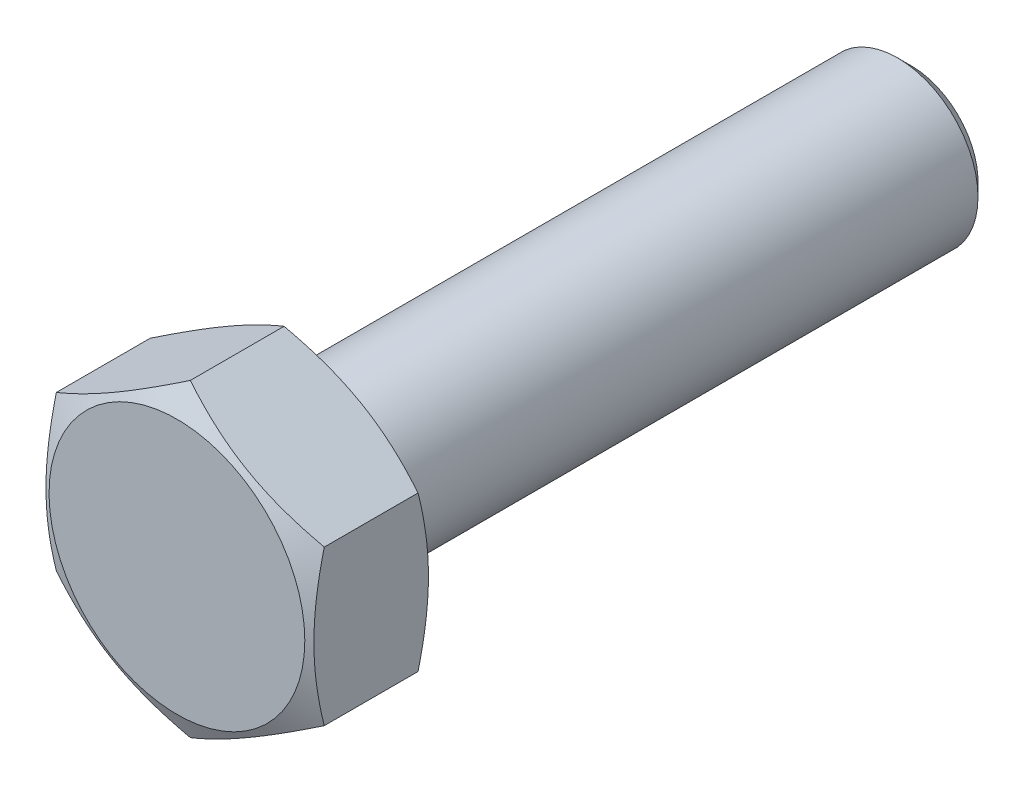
ISO-10303-21;
HEADER;
FILE_DESCRIPTION(('STEP AP214'),'2;1');
FILE_NAME('part.step','',(''),(''),'','','');
FILE_SCHEMA(('AUTOMOTIVE_DESIGN { 1 0 10303 214 1 1 1 1 }'));
ENDSEC;
DATA;
#1=APPLICATION_CONTEXT('core data for automotive mechanical design processes');
#2=APPLICATION_PROTOCOL_DEFINITION('international standard','automotive_design',2000,#1);
#3=PRODUCT_CONTEXT('',#1,'mechanical');
#4=PRODUCT('Part','Part','',(#3));
#5=PRODUCT_RELATED_PRODUCT_CATEGORY('part','',(#4));
#6=PRODUCT_DEFINITION_FORMATION('','',#4);
#7=PRODUCT_DEFINITION_CONTEXT('part definition',#1,'design');
#8=PRODUCT_DEFINITION('design','',#6,#7);
#9=PRODUCT_DEFINITION_SHAPE('','',#8);
#10=(LENGTH_UNIT() NAMED_UNIT(*) SI_UNIT(.MILLI.,.METRE.));
#11=(NAMED_UNIT(*) PLANE_ANGLE_UNIT() SI_UNIT($,.RADIAN.));
#12=(NAMED_UNIT(*) SI_UNIT($,.STERADIAN.) SOLID_ANGLE_UNIT());
#13=UNCERTAINTY_MEASURE_WITH_UNIT(LENGTH_MEASURE(1.E-05),#10,'distance_accuracy_value','');
#14=(GEOMETRIC_REPRESENTATION_CONTEXT(3) GLOBAL_UNCERTAINTY_ASSIGNED_CONTEXT((#13)) GLOBAL_UNIT_ASSIGNED_CONTEXT((#10,
#11,#12)) REPRESENTATION_CONTEXT('',''));
#15=CARTESIAN_POINT('',(0.,0.,0.));
#16=DIRECTION('',(0.,0.,1.));
#17=DIRECTION('',(1.,0.,0.));
#18=AXIS2_PLACEMENT_3D('',#15,#16,#17);
#19=CARTESIAN_POINT('',(5.,2.88675134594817,-4.5));
#20=DIRECTION('',(0.,0.,-1.));
#21=DIRECTION('',(-1.,0.,0.));
#22=AXIS2_PLACEMENT_3D('',#19,#20,#21);
#23=PLANE('',#22);
#24=CARTESIAN_POINT('',(0.,0.,-4.5));
#25=DIRECTION('',(0.,0.,1.));
#26=DIRECTION('',(1.,0.,0.));
#27=AXIS2_PLACEMENT_3D('',#24,#25,#26);
#28=CIRCLE('',#27,4.77350269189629);
#29=CARTESIAN_POINT('',(4.77350269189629,0.,-4.5));
#30=VERTEX_POINT('',#29);
#31=EDGE_CURVE('E546',#30,#30,#28,.T.);
#32=ORIENTED_EDGE('',*,*,#31,.F.);
#33=EDGE_LOOP('',(#32));
#34=FACE_BOUND('',#33,.T.);
#35=CARTESIAN_POINT('',(0.,0.,-4.5));
#36=DIRECTION('',(0.,0.,1.));
#37=DIRECTION('',(1.,0.,0.));
#38=AXIS2_PLACEMENT_3D('',#35,#36,#37);
#39=CIRCLE('',#38,2.85);
#40=CARTESIAN_POINT('',(2.85,0.,-4.5));
#41=VERTEX_POINT('',#40);
#42=EDGE_CURVE('E549',#41,#41,#39,.T.);
#43=ORIENTED_EDGE('',*,*,#42,.T.);
#44=EDGE_LOOP('',(#43));
#45=FACE_BOUND('',#44,.T.);
#46=ADVANCED_FACE('F352',(#34,#45),#23,.T.);
#47=CARTESIAN_POINT('',(0.,0.,-4.));
#48=DIRECTION('',(0.,0.,1.));
#49=DIRECTION('',(1.,0.,0.));
#50=AXIS2_PLACEMENT_3D('',#47,#48,#49);
#51=CONICAL_SURFACE('',#50,5.77350269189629,1.10714871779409);
#52=ORIENTED_EDGE('',*,*,#31,.T.);
#53=EDGE_LOOP('',(#52));
#54=FACE_BOUND('',#53,.T.);
#55=CARTESIAN_POINT('',(5.,-7.64036599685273,-2.32125048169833));
#56=CARTESIAN_POINT('',(5.,-7.41641352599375,-2.41491890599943));
#57=CARTESIAN_POINT('',(5.,-7.1920335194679,-2.50758419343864));
#58=CARTESIAN_POINT('',(5.,-6.74218875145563,-2.69033469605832));
#59=CARTESIAN_POINT('',(5.,-6.51672383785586,-2.78041953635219));
#60=CARTESIAN_POINT('',(5.,-6.06363519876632,-2.957763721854));
#61=CARTESIAN_POINT('',(5.,-5.83600643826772,-3.04501025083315));
#62=CARTESIAN_POINT('',(5.,-5.37924898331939,-3.2154711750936));
#63=CARTESIAN_POINT('',(5.,-5.15012035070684,-3.29868573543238));
#64=CARTESIAN_POINT('',(5.,-4.69320015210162,-3.45892511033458));
#65=CARTESIAN_POINT('',(5.,-4.46543286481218,-3.53601878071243));
#66=CARTESIAN_POINT('',(5.,-4.00783934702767,-3.68392873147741));
#67=CARTESIAN_POINT('',(5.,-3.77801298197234,-3.75474459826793));
#68=CARTESIAN_POINT('',(5.,-3.31631663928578,-3.88831127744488));
#69=CARTESIAN_POINT('',(5.,-3.08444962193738,-3.95107220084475));
#70=CARTESIAN_POINT('',(5.,-2.61825844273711,-4.06654482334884));
#71=CARTESIAN_POINT('',(5.,-2.3839347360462,-4.11925835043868));
#72=CARTESIAN_POINT('',(5.,-1.84988522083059,-4.22464925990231));
#73=CARTESIAN_POINT('',(5.,-1.54938237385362,-4.27356824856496));
#74=CARTESIAN_POINT('',(5.,-1.09646445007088,-4.3283971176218));
#75=CARTESIAN_POINT('',(5.,-0.94514546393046,-4.34358125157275));
#76=CARTESIAN_POINT('',(5.,-0.641979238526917,-4.36733897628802));
#77=CARTESIAN_POINT('',(5.,-0.490132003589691,-4.37591262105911));
#78=CARTESIAN_POINT('',(5.,-0.185604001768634,-4.38618760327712));
#79=CARTESIAN_POINT('',(5.,-0.0329223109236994,-4.38786167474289));
#80=CARTESIAN_POINT('',(5.,0.272359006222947,-4.38420797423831));
#81=CARTESIAN_POINT('',(5.,0.424958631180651,-4.3788800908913));
#82=CARTESIAN_POINT('',(5.,0.729745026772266,-4.36139946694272));
#83=CARTESIAN_POINT('',(5.,0.881931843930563,-4.34924753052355));
#84=CARTESIAN_POINT('',(5.,1.18563651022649,-4.31850255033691));
#85=CARTESIAN_POINT('',(5.,1.33715439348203,-4.29990983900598));
#86=CARTESIAN_POINT('',(5.,1.70863721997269,-4.24691969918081));
#87=CARTESIAN_POINT('',(5.,1.92812791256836,-4.20918449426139));
#88=CARTESIAN_POINT('',(5.,2.3650239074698,-4.1230142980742));
#89=CARTESIAN_POINT('',(5.,2.58242857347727,-4.07457614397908));
#90=CARTESIAN_POINT('',(5.,3.0153417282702,-3.96885167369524));
#91=CARTESIAN_POINT('',(5.,3.23084750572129,-3.91155436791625));
#92=CARTESIAN_POINT('',(5.,3.65980768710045,-3.78985788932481));
#93=CARTESIAN_POINT('',(5.,3.8732622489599,-3.72545926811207));
#94=CARTESIAN_POINT('',(5.,4.2999453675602,-3.59046413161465));
#95=CARTESIAN_POINT('',(5.,4.51316032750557,-3.51982491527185));
#96=CARTESIAN_POINT('',(5.,4.93799569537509,-3.37391851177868));
#97=CARTESIAN_POINT('',(5.,5.14961608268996,-3.29865126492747));
#98=CARTESIAN_POINT('',(5.,5.57135611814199,-3.14444821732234));
#99=CARTESIAN_POINT('',(5.,5.78147664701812,-3.06551481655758));
#100=CARTESIAN_POINT('',(5.,6.2005631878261,-2.90463477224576));
#101=CARTESIAN_POINT('',(5.,6.40952917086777,-2.82268805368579));
#102=CARTESIAN_POINT('',(5.,7.0394166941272,-2.57141566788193));
#103=CARTESIAN_POINT('',(5.,7.45883645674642,-2.39832815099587));
#104=CARTESIAN_POINT('',(5.,8.29487839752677,-2.04538981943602));
#105=CARTESIAN_POINT('',(5.,8.71150009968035,-1.86553788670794));
#106=CARTESIAN_POINT('',(5.,9.5356228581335,-1.50414959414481));
#107=CARTESIAN_POINT('',(5.,9.94315902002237,-1.32269313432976));
#108=CARTESIAN_POINT('',(5.,10.553266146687,-1.04800855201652));
#109=CARTESIAN_POINT('',(5.,10.7564078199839,-0.956043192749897));
#110=CARTESIAN_POINT('',(5.,11.1623558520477,-0.771379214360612));
#111=CARTESIAN_POINT('',(5.,11.3651622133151,-0.678680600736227));
#112=CARTESIAN_POINT('',(5.,11.5678248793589,-0.585668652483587));
#113=B_SPLINE_CURVE_WITH_KNOTS('',3,(#55,#56,#57,#58,#59,#60,#61,#62,#63,#64,#65,#66,#67,#68,
#69,#70,#71,#72,#73,#74,#75,#76,#77,#78,#79,#80,#81,#82,#83,#84,#85,#86,#87,#88,#89,#90,#91,#92,
#93,#94,#95,#96,#97,#98,#99,#100,#101,#102,#103,#104,#105,#106,#107,#108,#109,#110,#111,#112),
.UNSPECIFIED.,.F.,.F.,(4,2,2,2,2,2,2,2,2,2,2,2,2,2,2,2,2,2,2,2,2,2,2,2,2,2,2,2,4),(0.,
0.728264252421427,1.45663377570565,2.18793174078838,2.91919974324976,3.64051008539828,
4.36186791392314,5.08231120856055,5.80262330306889,6.71502470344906,7.17114003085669,
7.62725163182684,8.08516399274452,8.54308363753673,9.00094932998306,9.4587913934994,
10.1265851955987,10.7945766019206,11.4634033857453,12.1321782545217,12.8059483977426,
13.4797272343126,14.153071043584,14.8264316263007,16.1875243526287,17.5488430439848,
18.8871439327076,19.5561104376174,20.2250719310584),.UNSPECIFIED.);
#114=CARTESIAN_POINT('',(5.0000000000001,-2.88675134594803,-4.));
#115=VERTEX_POINT('',#114);
#116=CARTESIAN_POINT('',(5.,2.8867513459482,-4.));
#117=VERTEX_POINT('',#116);
#118=EDGE_CURVE('E408',#115,#117,#113,.T.);
#119=ORIENTED_EDGE('',*,*,#118,.F.);
#120=CARTESIAN_POINT('',(-0.000199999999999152,-5.77361816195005,-3.9999422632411));
#121=CARTESIAN_POINT('',(0.140726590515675,-5.69225415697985,-4.04062369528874));
#122=CARTESIAN_POINT('',(0.282202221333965,-5.61057316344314,-4.07889097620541));
#123=CARTESIAN_POINT('',(0.566280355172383,-5.44656057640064,-4.14979140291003));
#124=CARTESIAN_POINT('',(0.70888339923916,-5.36422867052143,-4.18242164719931));
#125=CARTESIAN_POINT('',(0.995312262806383,-5.19885888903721,-4.24124222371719));
#126=CARTESIAN_POINT('',(1.13913957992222,-5.11582014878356,-4.26742295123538));
#127=CARTESIAN_POINT('',(1.42763357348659,-4.94925806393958,-4.31247492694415));
#128=CARTESIAN_POINT('',(1.57230010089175,-4.86573480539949,-4.33134743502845));
#129=CARTESIAN_POINT('',(1.85896625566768,-4.70022802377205,-4.36078685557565));
#130=CARTESIAN_POINT('',(2.00095198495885,-4.61825252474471,-4.37153237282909));
#131=CARTESIAN_POINT('',(2.28521904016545,-4.45413086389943,-4.38501401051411));
#132=CARTESIAN_POINT('',(2.42750038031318,-4.37198469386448,-4.38774973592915));
#133=CARTESIAN_POINT('',(2.71185220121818,-4.20781409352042,-4.38510569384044));
#134=CARTESIAN_POINT('',(2.85392274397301,-4.125789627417,-4.37973466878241));
#135=CARTESIAN_POINT('',(3.13765894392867,-3.96197445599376,-4.36110026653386));
#136=CARTESIAN_POINT('',(3.27932463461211,-3.88018373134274,-4.34783756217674));
#137=CARTESIAN_POINT('',(3.55309412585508,-3.7221228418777,-4.31496770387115));
#138=CARTESIAN_POINT('',(3.68523915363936,-3.64582887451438,-4.2958118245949));
#139=CARTESIAN_POINT('',(3.94878685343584,-3.49366953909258,-4.25153571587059));
#140=CARTESIAN_POINT('',(4.08018944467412,-3.41780421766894,-4.22641484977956));
#141=CARTESIAN_POINT('',(4.34359688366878,-3.26572586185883,-4.17052416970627));
#142=CARTESIAN_POINT('',(4.47559210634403,-3.18951838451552,-4.13969448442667));
#143=CARTESIAN_POINT('',(4.73861395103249,-3.03766265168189,-4.07324670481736));
#144=CARTESIAN_POINT('',(4.86964099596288,-2.96201415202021,-4.03763084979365));
#145=CARTESIAN_POINT('',(5.0002,-2.88663587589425,-3.99994226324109));
#146=B_SPLINE_CURVE_WITH_KNOTS('',3,(#120,#121,#122,#123,#124,#125,#126,#127,#128,#129,#130,
#131,#132,#133,#134,#135,#136,#137,#138,#139,#140,#141,#142,#143,#144,#145),.UNSPECIFIED.,.F.,
.F.,(4,2,2,2,2,2,2,2,2,2,2,2,4),(0.,0.503233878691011,1.00672601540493,1.51096348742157,
2.01511399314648,2.50783431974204,3.00057894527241,3.49279256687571,3.9849642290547,
4.44619450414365,4.90747402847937,5.37389760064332,5.84010370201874),.UNSPECIFIED.);
#147=CARTESIAN_POINT('',(1.37476835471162E-13,-5.77350269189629,-4.));
#148=VERTEX_POINT('',#147);
#149=EDGE_CURVE('E421',#148,#115,#146,.T.);
#150=ORIENTED_EDGE('',*,*,#149,.F.);
#151=CARTESIAN_POINT('',(-5.0002,-2.88663587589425,-3.9999422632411));
#152=CARTESIAN_POINT('',(-4.85927340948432,-2.96799988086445,-4.04062369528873));
#153=CARTESIAN_POINT('',(-4.71779777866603,-3.04968087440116,-4.0788909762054));
#154=CARTESIAN_POINT('',(-4.43371964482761,-3.21369346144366,-4.14979140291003));
#155=CARTESIAN_POINT('',(-4.29111660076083,-3.29602536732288,-4.1824216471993));
#156=CARTESIAN_POINT('',(-4.00468773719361,-3.46139514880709,-4.24124222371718));
#157=CARTESIAN_POINT('',(-3.86086042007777,-3.54443388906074,-4.26742295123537));
#158=CARTESIAN_POINT('',(-3.5723664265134,-3.71099597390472,-4.31247492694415));
#159=CARTESIAN_POINT('',(-3.42769989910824,-3.79451923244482,-4.33134743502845));
#160=CARTESIAN_POINT('',(-3.14103374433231,-3.96002601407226,-4.36078685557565));
#161=CARTESIAN_POINT('',(-2.99904801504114,-4.0420015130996,-4.37153237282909));
#162=CARTESIAN_POINT('',(-2.71478095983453,-4.20612317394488,-4.38501401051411));
#163=CARTESIAN_POINT('',(-2.57249961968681,-4.28826934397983,-4.38774973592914));
#164=CARTESIAN_POINT('',(-2.2881477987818,-4.45243994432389,-4.38510569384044));
#165=CARTESIAN_POINT('',(-2.14607725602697,-4.53446441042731,-4.37973466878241));
#166=CARTESIAN_POINT('',(-1.86234105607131,-4.69827958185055,-4.36110026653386));
#167=CARTESIAN_POINT('',(-1.72067536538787,-4.78007030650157,-4.34783756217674));
#168=CARTESIAN_POINT('',(-1.4469058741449,-4.93813119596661,-4.31496770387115));
#169=CARTESIAN_POINT('',(-1.31476084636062,-5.01442516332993,-4.2958118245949));
#170=CARTESIAN_POINT('',(-1.05121314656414,-5.16658449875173,-4.2515357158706));
#171=CARTESIAN_POINT('',(-0.919810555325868,-5.24244982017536,-4.22641484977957));
#172=CARTESIAN_POINT('',(-0.656403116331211,-5.39452817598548,-4.17052416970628));
#173=CARTESIAN_POINT('',(-0.524407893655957,-5.47073565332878,-4.13969448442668));
#174=CARTESIAN_POINT('',(-0.261386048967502,-5.62259138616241,-4.07324670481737));
#175=CARTESIAN_POINT('',(-0.130359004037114,-5.69823988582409,-4.03763084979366));
#176=CARTESIAN_POINT('',(0.000200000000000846,-5.77361816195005,-3.9999422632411));
#177=B_SPLINE_CURVE_WITH_KNOTS('',3,(#151,#152,#153,#154,#155,#156,#157,#158,#159,#160,#161,
#162,#163,#164,#165,#166,#167,#168,#169,#170,#171,#172,#173,#174,#175,#176),.UNSPECIFIED.,.F.,
.F.,(4,2,2,2,2,2,2,2,2,2,2,2,4),(0.,0.503233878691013,1.00672601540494,1.51096348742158,
2.01511399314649,2.50783431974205,3.00057894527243,3.49279256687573,3.98496422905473,
4.44619450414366,4.90747402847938,5.37389760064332,5.84010370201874),.UNSPECIFIED.);
#178=CARTESIAN_POINT('',(-5.,-2.88675134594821,-4.));
#179=VERTEX_POINT('',#178);
#180=EDGE_CURVE('E500',#179,#148,#177,.T.);
#181=ORIENTED_EDGE('',*,*,#180,.F.);
#182=CARTESIAN_POINT('',(-5.,-7.64036599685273,-2.32125048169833));
#183=CARTESIAN_POINT('',(-5.,-7.41641352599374,-2.41491890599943));
#184=CARTESIAN_POINT('',(-5.,-7.1920335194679,-2.50758419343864));
#185=CARTESIAN_POINT('',(-5.,-6.74218875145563,-2.69033469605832));
#186=CARTESIAN_POINT('',(-5.,-6.51672383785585,-2.78041953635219));
#187=CARTESIAN_POINT('',(-5.,-6.06363519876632,-2.95776372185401));
#188=CARTESIAN_POINT('',(-5.,-5.83600643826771,-3.04501025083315));
#189=CARTESIAN_POINT('',(-5.,-5.37924898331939,-3.2154711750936));
#190=CARTESIAN_POINT('',(-5.,-5.15012035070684,-3.29868573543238));
#191=CARTESIAN_POINT('',(-5.,-4.69320015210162,-3.45892511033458));
#192=CARTESIAN_POINT('',(-5.,-4.46543286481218,-3.53601878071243));
#193=CARTESIAN_POINT('',(-5.,-4.00783934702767,-3.68392873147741));
#194=CARTESIAN_POINT('',(-5.,-3.77801298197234,-3.75474459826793));
#195=CARTESIAN_POINT('',(-5.,-3.31631663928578,-3.88831127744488));
#196=CARTESIAN_POINT('',(-5.,-3.08444962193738,-3.95107220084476));
#197=CARTESIAN_POINT('',(-5.,-2.61825844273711,-4.06654482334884));
#198=CARTESIAN_POINT('',(-5.,-2.3839347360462,-4.11925835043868));
#199=CARTESIAN_POINT('',(-5.,-1.8498852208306,-4.22464925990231));
#200=CARTESIAN_POINT('',(-5.,-1.54938237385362,-4.27356824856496));
#201=CARTESIAN_POINT('',(-5.,-1.09646445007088,-4.3283971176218));
#202=CARTESIAN_POINT('',(-5.,-0.945145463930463,-4.34358125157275));
#203=CARTESIAN_POINT('',(-5.,-0.64197923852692,-4.36733897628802));
#204=CARTESIAN_POINT('',(-5.,-0.490132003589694,-4.37591262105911));
#205=CARTESIAN_POINT('',(-5.,-0.185604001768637,-4.38618760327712));
#206=CARTESIAN_POINT('',(-5.,-0.0329223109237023,-4.38786167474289));
#207=CARTESIAN_POINT('',(-5.,0.272359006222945,-4.38420797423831));
#208=CARTESIAN_POINT('',(-5.,0.424958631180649,-4.3788800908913));
#209=CARTESIAN_POINT('',(-5.,0.729745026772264,-4.36139946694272));
#210=CARTESIAN_POINT('',(-5.,0.88193184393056,-4.34924753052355));
#211=CARTESIAN_POINT('',(-5.,1.18563651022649,-4.31850255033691));
#212=CARTESIAN_POINT('',(-5.,1.33715439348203,-4.29990983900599));
#213=CARTESIAN_POINT('',(-5.,1.70863721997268,-4.24691969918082));
#214=CARTESIAN_POINT('',(-5.,1.92812791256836,-4.20918449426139));
#215=CARTESIAN_POINT('',(-5.,2.36502390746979,-4.1230142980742));
#216=CARTESIAN_POINT('',(-5.,2.58242857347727,-4.07457614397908));
#217=CARTESIAN_POINT('',(-5.,3.0153417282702,-3.96885167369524));
#218=CARTESIAN_POINT('',(-5.,3.23084750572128,-3.91155436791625));
#219=CARTESIAN_POINT('',(-5.,3.65980768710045,-3.78985788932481));
#220=CARTESIAN_POINT('',(-5.,3.8732622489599,-3.72545926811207));
#221=CARTESIAN_POINT('',(-5.,4.29994536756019,-3.59046413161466));
#222=CARTESIAN_POINT('',(-5.,4.51316032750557,-3.51982491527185));
#223=CARTESIAN_POINT('',(-5.,4.93799569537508,-3.37391851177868));
#224=CARTESIAN_POINT('',(-5.,5.14961608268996,-3.29865126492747));
#225=CARTESIAN_POINT('',(-5.,5.57135611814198,-3.14444821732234));
#226=CARTESIAN_POINT('',(-5.,5.78147664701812,-3.06551481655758));
#227=CARTESIAN_POINT('',(-5.,6.2005631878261,-2.90463477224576));
#228=CARTESIAN_POINT('',(-5.,6.40952917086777,-2.82268805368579));
#229=CARTESIAN_POINT('',(-5.,7.0394166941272,-2.57141566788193));
#230=CARTESIAN_POINT('',(-5.,7.45883645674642,-2.39832815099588));
#231=CARTESIAN_POINT('',(-5.,8.29487839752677,-2.04538981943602));
#232=CARTESIAN_POINT('',(-5.,8.71150009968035,-1.86553788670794));
#233=CARTESIAN_POINT('',(-5.,9.5356228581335,-1.50414959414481));
#234=CARTESIAN_POINT('',(-5.,9.94315902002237,-1.32269313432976));
#235=CARTESIAN_POINT('',(-5.,10.553266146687,-1.04800855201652));
#236=CARTESIAN_POINT('',(-5.,10.7564078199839,-0.956043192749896));
#237=CARTESIAN_POINT('',(-5.,11.1623558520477,-0.771379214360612));
#238=CARTESIAN_POINT('',(-5.,11.3651622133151,-0.678680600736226));
#239=CARTESIAN_POINT('',(-5.,11.5678248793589,-0.585668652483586));
#240=B_SPLINE_CURVE_WITH_KNOTS('',3,(#182,#183,#184,#185,#186,#187,#188,#189,#190,#191,#192,
#193,#194,#195,#196,#197,#198,#199,#200,#201,#202,#203,#204,#205,#206,#207,#208,#209,#210,#211,
#212,#213,#214,#215,#216,#217,#218,#219,#220,#221,#222,#223,#224,#225,#226,#227,#228,#229,#230,
#231,#232,#233,#234,#235,#236,#237,#238,#239),.UNSPECIFIED.,.F.,.F.,(4,2,2,2,2,2,2,2,2,2,2,2,2,
2,2,2,2,2,2,2,2,2,2,2,2,2,2,2,4),(0.,0.728264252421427,1.45663377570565,2.18793174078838,
2.91919974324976,3.64051008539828,4.36186791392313,5.08231120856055,5.80262330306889,
6.71502470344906,7.17114003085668,7.62725163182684,8.08516399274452,8.54308363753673,
9.00094932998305,9.45879139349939,10.1265851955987,10.7945766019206,11.4634033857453,
12.1321782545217,12.8059483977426,13.4797272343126,14.153071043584,14.8264316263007,
16.1875243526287,17.5488430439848,18.8871439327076,19.5561104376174,20.2250719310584),.UNSPECIFIED.);
#241=CARTESIAN_POINT('',(-5.,2.88675134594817,-4.));
#242=VERTEX_POINT('',#241);
#243=EDGE_CURVE('E368',#242,#179,#240,.F.);
#244=ORIENTED_EDGE('',*,*,#243,.F.);
#245=CARTESIAN_POINT('',(0.000199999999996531,5.77361816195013,-3.99994226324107));
#246=CARTESIAN_POINT('',(-0.140726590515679,5.69225415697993,-4.0406236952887));
#247=CARTESIAN_POINT('',(-0.282202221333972,5.61057316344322,-4.07889097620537));
#248=CARTESIAN_POINT('',(-0.566280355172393,5.44656057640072,-4.14979140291));
#249=CARTESIAN_POINT('',(-0.708883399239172,5.3642286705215,-4.18242164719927));
#250=CARTESIAN_POINT('',(-0.995312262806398,5.19885888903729,-4.24124222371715));
#251=CARTESIAN_POINT('',(-1.13913957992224,5.11582014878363,-4.26742295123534));
#252=CARTESIAN_POINT('',(-1.42763357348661,4.94925806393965,-4.31247492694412));
#253=CARTESIAN_POINT('',(-1.57230010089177,4.86573480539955,-4.33134743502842));
#254=CARTESIAN_POINT('',(-1.85896625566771,4.70022802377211,-4.36078685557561));
#255=CARTESIAN_POINT('',(-2.00095198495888,4.61825252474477,-4.37153237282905));
#256=CARTESIAN_POINT('',(-2.28521904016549,4.45413086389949,-4.38501401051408));
#257=CARTESIAN_POINT('',(-2.42750038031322,4.37198469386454,-4.38774973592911));
#258=CARTESIAN_POINT('',(-2.71185220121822,4.20781409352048,-4.3851056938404));
#259=CARTESIAN_POINT('',(-2.85392274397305,4.12578962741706,-4.37973466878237));
#260=CARTESIAN_POINT('',(-3.13765894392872,3.96197445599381,-4.36110026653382));
#261=CARTESIAN_POINT('',(-3.27932463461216,3.88018373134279,-4.3478375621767));
#262=CARTESIAN_POINT('',(-3.55309412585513,3.72212284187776,-4.31496770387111));
#263=CARTESIAN_POINT('',(-3.6852391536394,3.64582887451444,-4.29581182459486));
#264=CARTESIAN_POINT('',(-3.94878685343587,3.49366953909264,-4.25153571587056));
#265=CARTESIAN_POINT('',(-4.08018944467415,3.41780421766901,-4.22641484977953));
#266=CARTESIAN_POINT('',(-4.3435968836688,3.2657258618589,-4.17052416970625));
#267=CARTESIAN_POINT('',(-4.47559210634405,3.18951838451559,-4.13969448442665));
#268=CARTESIAN_POINT('',(-4.7386139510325,3.03766265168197,-4.07324670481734));
#269=CARTESIAN_POINT('',(-4.86964099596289,2.96201415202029,-4.03763084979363));
#270=CARTESIAN_POINT('',(-5.0002,2.88663587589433,-3.99994226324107));
#271=B_SPLINE_CURVE_WITH_KNOTS('',3,(#245,#246,#247,#248,#249,#250,#251,#252,#253,#254,#255,
#256,#257,#258,#259,#260,#261,#262,#263,#264,#265,#266,#267,#268,#269,#270),.UNSPECIFIED.,.F.,
.F.,(4,2,2,2,2,2,2,2,2,2,2,2,4),(0.,0.503233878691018,1.00672601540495,1.5109634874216,
2.0151139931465,2.50783431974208,3.00057894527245,3.49279256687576,3.98496422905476,
4.44619450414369,4.90747402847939,5.37389760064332,5.84010370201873),.UNSPECIFIED.);
#272=CARTESIAN_POINT('',(0.,5.77350269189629,-4.));
#273=VERTEX_POINT('',#272);
#274=EDGE_CURVE('E410',#273,#242,#271,.T.);
#275=ORIENTED_EDGE('',*,*,#274,.F.);
#276=CARTESIAN_POINT('',(5.0002,2.88663587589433,-3.99994226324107));
#277=CARTESIAN_POINT('',(4.85927340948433,2.96799988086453,-4.04062369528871));
#278=CARTESIAN_POINT('',(4.71779777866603,3.04968087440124,-4.07889097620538));
#279=CARTESIAN_POINT('',(4.43371964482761,3.21369346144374,-4.14979140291));
#280=CARTESIAN_POINT('',(4.29111660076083,3.29602536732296,-4.18242164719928));
#281=CARTESIAN_POINT('',(4.00468773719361,3.46139514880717,-4.24124222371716));
#282=CARTESIAN_POINT('',(3.86086042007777,3.54443388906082,-4.26742295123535));
#283=CARTESIAN_POINT('',(3.5723664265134,3.7109959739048,-4.31247492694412));
#284=CARTESIAN_POINT('',(3.42769989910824,3.7945192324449,-4.33134743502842));
#285=CARTESIAN_POINT('',(3.1410337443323,3.96002601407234,-4.36078685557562));
#286=CARTESIAN_POINT('',(2.99904801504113,4.04200151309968,-4.37153237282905));
#287=CARTESIAN_POINT('',(2.71478095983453,4.20612317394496,-4.38501401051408));
#288=CARTESIAN_POINT('',(2.5724996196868,4.28826934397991,-4.38774973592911));
#289=CARTESIAN_POINT('',(2.28814779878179,4.45243994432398,-4.3851056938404));
#290=CARTESIAN_POINT('',(2.14607725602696,4.53446441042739,-4.37973466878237));
#291=CARTESIAN_POINT('',(1.8623410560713,4.69827958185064,-4.36110026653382));
#292=CARTESIAN_POINT('',(1.72067536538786,4.78007030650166,-4.3478375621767));
#293=CARTESIAN_POINT('',(1.44690587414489,4.93813119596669,-4.31496770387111));
#294=CARTESIAN_POINT('',(1.31476084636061,5.01442516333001,-4.29581182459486));
#295=CARTESIAN_POINT('',(1.05121314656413,5.16658449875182,-4.25153571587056));
#296=CARTESIAN_POINT('',(0.91981055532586,5.24244982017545,-4.22641484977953));
#297=CARTESIAN_POINT('',(0.656403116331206,5.39452817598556,-4.17052416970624));
#298=CARTESIAN_POINT('',(0.524407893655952,5.47073565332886,-4.13969448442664));
#299=CARTESIAN_POINT('',(0.261386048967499,5.62259138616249,-4.07324670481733));
#300=CARTESIAN_POINT('',(0.130359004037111,5.69823988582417,-4.03763084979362));
#301=CARTESIAN_POINT('',(-0.000200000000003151,5.77361816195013,-3.99994226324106));
#302=B_SPLINE_CURVE_WITH_KNOTS('',3,(#276,#277,#278,#279,#280,#281,#282,#283,#284,#285,#286,
#287,#288,#289,#290,#291,#292,#293,#294,#295,#296,#297,#298,#299,#300,#301),.UNSPECIFIED.,.F.,
.F.,(4,2,2,2,2,2,2,2,2,2,2,2,4),(0.,0.503233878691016,1.00672601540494,1.51096348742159,
2.01511399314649,2.50783431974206,3.00057894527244,3.49279256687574,3.98496422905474,
4.44619450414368,4.90747402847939,5.37389760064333,5.84010370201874),.UNSPECIFIED.);
#303=EDGE_CURVE('E405',#117,#273,#302,.T.);
#304=ORIENTED_EDGE('',*,*,#303,.F.);
#305=EDGE_LOOP('',(#119,#150,#181,#244,#275,#304));
#306=FACE_BOUND('',#305,.T.);
#307=ADVANCED_FACE('F407',(#54,#306),#51,.T.);
#308=CARTESIAN_POINT('',(5.,2.88675134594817,0.));
#309=DIRECTION('',(0.,0.,-1.));
#310=DIRECTION('',(-1.,0.,0.));
#311=AXIS2_PLACEMENT_3D('',#308,#309,#310);
#312=PLANE('',#311);
#313=CARTESIAN_POINT('',(0.,0.,0.));
#314=DIRECTION('',(0.,0.,1.));
#315=DIRECTION('',(1.,0.,0.));
#316=AXIS2_PLACEMENT_3D('',#313,#314,#315);
#317=CIRCLE('',#316,4.77350269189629);
#318=CARTESIAN_POINT('',(4.77350269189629,0.,0.));
#319=VERTEX_POINT('',#318);
#320=EDGE_CURVE('E412',#319,#319,#317,.T.);
#321=ORIENTED_EDGE('',*,*,#320,.T.);
#322=EDGE_LOOP('',(#321));
#323=FACE_BOUND('',#322,.T.);
#324=ADVANCED_FACE('F481',(#323),#312,.F.);
#325=CARTESIAN_POINT('',(0.,0.,0.));
#326=DIRECTION('',(0.,0.,-1.));
#327=DIRECTION('',(-1.,0.,0.));
#328=AXIS2_PLACEMENT_3D('',#325,#326,#327);
#329=CONICAL_SURFACE('',#328,4.77350269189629,1.10714871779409);
#330=CARTESIAN_POINT('',(-5.0002,2.88663587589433,-0.500057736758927));
#331=CARTESIAN_POINT('',(-4.85927340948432,2.96799988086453,-0.459376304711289));
#332=CARTESIAN_POINT('',(-4.71779777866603,3.04968087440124,-0.421109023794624));
#333=CARTESIAN_POINT('',(-4.43371964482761,3.21369346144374,-0.350208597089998));
#334=CARTESIAN_POINT('',(-4.29111660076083,3.29602536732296,-0.317578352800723));
#335=CARTESIAN_POINT('',(-4.00468773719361,3.46139514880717,-0.258757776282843));
#336=CARTESIAN_POINT('',(-3.86086042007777,3.54443388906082,-0.232577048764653));
#337=CARTESIAN_POINT('',(-3.5723664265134,3.7109959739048,-0.187525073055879));
#338=CARTESIAN_POINT('',(-3.42769989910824,3.7945192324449,-0.168652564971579));
#339=CARTESIAN_POINT('',(-3.1410337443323,3.96002601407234,-0.139213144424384));
#340=CARTESIAN_POINT('',(-2.99904801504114,4.04200151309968,-0.128467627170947));
#341=CARTESIAN_POINT('',(-2.71478095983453,4.20612317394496,-0.11498598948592));
#342=CARTESIAN_POINT('',(-2.5724996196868,4.28826934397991,-0.11225026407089));
#343=CARTESIAN_POINT('',(-2.2881477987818,4.45243994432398,-0.114894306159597));
#344=CARTESIAN_POINT('',(-2.14607725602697,4.53446441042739,-0.120265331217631));
#345=CARTESIAN_POINT('',(-1.8623410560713,4.69827958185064,-0.13889973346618));
#346=CARTESIAN_POINT('',(-1.72067536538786,4.78007030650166,-0.152162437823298));
#347=CARTESIAN_POINT('',(-1.44690587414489,4.93813119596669,-0.18503229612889));
#348=CARTESIAN_POINT('',(-1.31476084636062,5.01442516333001,-0.204188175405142));
#349=CARTESIAN_POINT('',(-1.05121314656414,5.16658449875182,-0.248464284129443));
#350=CARTESIAN_POINT('',(-0.919810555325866,5.24244982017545,-0.273585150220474));
#351=CARTESIAN_POINT('',(-0.656403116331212,5.39452817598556,-0.329475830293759));
#352=CARTESIAN_POINT('',(-0.524407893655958,5.47073565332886,-0.360305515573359));
#353=CARTESIAN_POINT('',(-0.261386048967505,5.62259138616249,-0.426753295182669));
#354=CARTESIAN_POINT('',(-0.130359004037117,5.69823988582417,-0.462369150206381));
#355=CARTESIAN_POINT('',(0.000199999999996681,5.77361816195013,-0.500057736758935));
#356=B_SPLINE_CURVE_WITH_KNOTS('',3,(#330,#331,#332,#333,#334,#335,#336,#337,#338,#339,#340,
#341,#342,#343,#344,#345,#346,#347,#348,#349,#350,#351,#352,#353,#354,#355),.UNSPECIFIED.,.F.,
.F.,(4,2,2,2,2,2,2,2,2,2,2,2,4),(0.,0.503233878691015,1.00672601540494,1.51096348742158,
2.01511399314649,2.50783431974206,3.00057894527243,3.49279256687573,3.98496422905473,
4.44619450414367,4.90747402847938,5.37389760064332,5.84010370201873),.UNSPECIFIED.);
#357=CARTESIAN_POINT('',(-5.00000000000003,2.88675134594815,-0.5));
#358=VERTEX_POINT('',#357);
#359=CARTESIAN_POINT('',(0.,5.77350269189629,-0.5));
#360=VERTEX_POINT('',#359);
#361=EDGE_CURVE('E523',#358,#360,#356,.T.);
#362=ORIENTED_EDGE('',*,*,#361,.F.);
#363=CARTESIAN_POINT('',(-5.,-7.64036599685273,-2.17874951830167));
#364=CARTESIAN_POINT('',(-5.,-7.41641352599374,-2.08508109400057));
#365=CARTESIAN_POINT('',(-5.,-7.1920335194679,-1.99241580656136));
#366=CARTESIAN_POINT('',(-5.,-6.74218875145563,-1.80966530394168));
#367=CARTESIAN_POINT('',(-5.,-6.51672383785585,-1.71958046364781));
#368=CARTESIAN_POINT('',(-5.,-6.06363519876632,-1.54223627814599));
#369=CARTESIAN_POINT('',(-5.,-5.83600643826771,-1.45498974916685));
#370=CARTESIAN_POINT('',(-5.,-5.37924898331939,-1.2845288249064));
#371=CARTESIAN_POINT('',(-5.,-5.15012035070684,-1.20131426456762));
#372=CARTESIAN_POINT('',(-5.,-4.69320015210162,-1.04107488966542));
#373=CARTESIAN_POINT('',(-5.,-4.46543286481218,-0.963981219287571));
#374=CARTESIAN_POINT('',(-5.,-4.00783934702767,-0.816071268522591));
#375=CARTESIAN_POINT('',(-5.,-3.77801298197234,-0.745255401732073));
#376=CARTESIAN_POINT('',(-5.,-3.31631663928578,-0.611688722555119));
#377=CARTESIAN_POINT('',(-5.,-3.08444962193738,-0.548927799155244));
#378=CARTESIAN_POINT('',(-5.,-2.61825844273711,-0.433455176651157));
#379=CARTESIAN_POINT('',(-5.,-2.3839347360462,-0.38074164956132));
#380=CARTESIAN_POINT('',(-5.,-1.8498852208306,-0.275350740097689));
#381=CARTESIAN_POINT('',(-5.,-1.54938237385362,-0.226431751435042));
#382=CARTESIAN_POINT('',(-5.,-1.09646445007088,-0.171602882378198));
#383=CARTESIAN_POINT('',(-5.,-0.945145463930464,-0.15641874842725));
#384=CARTESIAN_POINT('',(-5.,-0.641979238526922,-0.132661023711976));
#385=CARTESIAN_POINT('',(-5.,-0.490132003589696,-0.124087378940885));
#386=CARTESIAN_POINT('',(-5.,-0.18560400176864,-0.11381239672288));
#387=CARTESIAN_POINT('',(-5.,-0.032922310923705,-0.112138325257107));
#388=CARTESIAN_POINT('',(-5.,0.272359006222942,-0.115792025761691));
#389=CARTESIAN_POINT('',(-5.,0.424958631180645,-0.121119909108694));
#390=CARTESIAN_POINT('',(-5.,0.72974502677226,-0.138600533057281));
#391=CARTESIAN_POINT('',(-5.,0.881931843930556,-0.150752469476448));
#392=CARTESIAN_POINT('',(-5.,1.18563651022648,-0.181497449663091));
#393=CARTESIAN_POINT('',(-5.,1.33715439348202,-0.200090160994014));
#394=CARTESIAN_POINT('',(-5.,1.70863721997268,-0.253080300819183));
#395=CARTESIAN_POINT('',(-5.,1.92812791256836,-0.290815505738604));
#396=CARTESIAN_POINT('',(-5.,2.36502390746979,-0.376985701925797));
#397=CARTESIAN_POINT('',(-5.,2.58242857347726,-0.425423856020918));
#398=CARTESIAN_POINT('',(-5.,3.01534172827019,-0.531148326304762));
#399=CARTESIAN_POINT('',(-5.,3.23084750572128,-0.588445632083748));
#400=CARTESIAN_POINT('',(-5.,3.65980768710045,-0.710142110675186));
#401=CARTESIAN_POINT('',(-5.,3.8732622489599,-0.774540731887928));
#402=CARTESIAN_POINT('',(-5.,4.29994536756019,-0.909535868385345));
#403=CARTESIAN_POINT('',(-5.,4.51316032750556,-0.980175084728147));
#404=CARTESIAN_POINT('',(-5.,4.93799569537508,-1.12608148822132));
#405=CARTESIAN_POINT('',(-5.,5.14961608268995,-1.20134873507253));
#406=CARTESIAN_POINT('',(-5.,5.57135611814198,-1.35555178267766));
#407=CARTESIAN_POINT('',(-5.,5.78147664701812,-1.43448518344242));
#408=CARTESIAN_POINT('',(-5.,6.2005631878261,-1.59536522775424));
#409=CARTESIAN_POINT('',(-5.,6.40952917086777,-1.67731194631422));
#410=CARTESIAN_POINT('',(-5.,7.0394166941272,-1.92858433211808));
#411=CARTESIAN_POINT('',(-5.,7.45883645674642,-2.10167184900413));
#412=CARTESIAN_POINT('',(-5.,8.29487839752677,-2.45461018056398));
#413=CARTESIAN_POINT('',(-5.,8.71150009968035,-2.63446211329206));
#414=CARTESIAN_POINT('',(-5.,9.5356228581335,-2.99585040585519));
#415=CARTESIAN_POINT('',(-5.,9.94315902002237,-3.17730686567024));
#416=CARTESIAN_POINT('',(-5.,10.553266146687,-3.45199144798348));
#417=CARTESIAN_POINT('',(-5.,10.7564078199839,-3.54395680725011));
#418=CARTESIAN_POINT('',(-5.,11.1623558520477,-3.72862078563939));
#419=CARTESIAN_POINT('',(-5.,11.3651622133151,-3.82131939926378));
#420=CARTESIAN_POINT('',(-5.,11.5678248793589,-3.91433134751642));
#421=B_SPLINE_CURVE_WITH_KNOTS('',3,(#363,#364,#365,#366,#367,#368,#369,#370,#371,#372,#373,
#374,#375,#376,#377,#378,#379,#380,#381,#382,#383,#384,#385,#386,#387,#388,#389,#390,#391,#392,
#393,#394,#395,#396,#397,#398,#399,#400,#401,#402,#403,#404,#405,#406,#407,#408,#409,#410,#411,
#412,#413,#414,#415,#416,#417,#418,#419,#420),.UNSPECIFIED.,.F.,.F.,(4,2,2,2,2,2,2,2,2,2,2,2,2,
2,2,2,2,2,2,2,2,2,2,2,2,2,2,2,4),(0.,0.728264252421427,1.45663377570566,2.18793174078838,
2.91919974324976,3.64051008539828,4.36186791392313,5.08231120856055,5.80262330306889,
6.71502470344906,7.17114003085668,7.62725163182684,8.08516399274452,8.54308363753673,
9.00094932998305,9.45879139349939,10.1265851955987,10.7945766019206,11.4634033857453,
12.1321782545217,12.8059483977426,13.4797272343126,14.153071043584,14.8264316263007,
16.1875243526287,17.5488430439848,18.8871439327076,19.5561104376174,20.2250719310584),.UNSPECIFIED.);
#422=CARTESIAN_POINT('',(-5.,-2.88675134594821,-0.5));
#423=VERTEX_POINT('',#422);
#424=EDGE_CURVE('E517',#423,#358,#421,.T.);
#425=ORIENTED_EDGE('',*,*,#424,.F.);
#426=CARTESIAN_POINT('',(0.000200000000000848,-5.77361816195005,-0.500057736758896));
#427=CARTESIAN_POINT('',(-0.140726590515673,-5.69225415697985,-0.459376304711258));
#428=CARTESIAN_POINT('',(-0.282202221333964,-5.61057316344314,-0.421109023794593));
#429=CARTESIAN_POINT('',(-0.566280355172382,-5.44656057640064,-0.350208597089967));
#430=CARTESIAN_POINT('',(-0.708883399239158,-5.36422867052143,-0.317578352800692));
#431=CARTESIAN_POINT('',(-0.99531226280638,-5.19885888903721,-0.258757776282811));
#432=CARTESIAN_POINT('',(-1.13913957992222,-5.11582014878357,-0.23257704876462));
#433=CARTESIAN_POINT('',(-1.42763357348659,-4.94925806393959,-0.187525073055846));
#434=CARTESIAN_POINT('',(-1.57230010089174,-4.86573480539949,-0.168652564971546));
#435=CARTESIAN_POINT('',(-1.85896625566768,-4.70022802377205,-0.13921314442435));
#436=CARTESIAN_POINT('',(-2.00095198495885,-4.61825252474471,-0.128467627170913));
#437=CARTESIAN_POINT('',(-2.28521904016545,-4.45413086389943,-0.114985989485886));
#438=CARTESIAN_POINT('',(-2.42750038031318,-4.37198469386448,-0.112250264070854));
#439=CARTESIAN_POINT('',(-2.71185220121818,-4.20781409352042,-0.114894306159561));
#440=CARTESIAN_POINT('',(-2.85392274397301,-4.125789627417,-0.120265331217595));
#441=CARTESIAN_POINT('',(-3.13765894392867,-3.96197445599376,-0.138899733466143));
#442=CARTESIAN_POINT('',(-3.27932463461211,-3.88018373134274,-0.15216243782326));
#443=CARTESIAN_POINT('',(-3.55309412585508,-3.72212284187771,-0.185032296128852));
#444=CARTESIAN_POINT('',(-3.68523915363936,-3.64582887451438,-0.204188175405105));
#445=CARTESIAN_POINT('',(-3.94878685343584,-3.49366953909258,-0.248464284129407));
#446=CARTESIAN_POINT('',(-4.08018944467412,-3.41780421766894,-0.273585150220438));
#447=CARTESIAN_POINT('',(-4.34359688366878,-3.26572586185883,-0.329475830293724));
#448=CARTESIAN_POINT('',(-4.47559210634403,-3.18951838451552,-0.360305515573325));
#449=CARTESIAN_POINT('',(-4.73861395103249,-3.03766265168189,-0.426753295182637));
#450=CARTESIAN_POINT('',(-4.86964099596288,-2.96201415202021,-0.46236915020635));
#451=CARTESIAN_POINT('',(-5.0002,-2.88663587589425,-0.500057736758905));
#452=B_SPLINE_CURVE_WITH_KNOTS('',3,(#426,#427,#428,#429,#430,#431,#432,#433,#434,#435,#436,
#437,#438,#439,#440,#441,#442,#443,#444,#445,#446,#447,#448,#449,#450,#451),.UNSPECIFIED.,.F.,
.F.,(4,2,2,2,2,2,2,2,2,2,2,2,4),(0.,0.503233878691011,1.00672601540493,1.51096348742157,
2.01511399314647,2.50783431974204,3.00057894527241,3.49279256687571,3.9849642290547,
4.44619450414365,4.90747402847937,5.37389760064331,5.84010370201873),.UNSPECIFIED.);
#453=CARTESIAN_POINT('',(1.37476835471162E-13,-5.77350269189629,-0.5));
#454=VERTEX_POINT('',#453);
#455=EDGE_CURVE('E443',#454,#423,#452,.T.);
#456=ORIENTED_EDGE('',*,*,#455,.F.);
#457=CARTESIAN_POINT('',(5.0002,-2.88663587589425,-0.500057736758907));
#458=CARTESIAN_POINT('',(4.85927340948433,-2.96799988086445,-0.459376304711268));
#459=CARTESIAN_POINT('',(4.71779777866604,-3.04968087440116,-0.421109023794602));
#460=CARTESIAN_POINT('',(4.43371964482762,-3.21369346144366,-0.350208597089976));
#461=CARTESIAN_POINT('',(4.29111660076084,-3.29602536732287,-0.3175783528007));
#462=CARTESIAN_POINT('',(4.00468773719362,-3.46139514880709,-0.258757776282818));
#463=CARTESIAN_POINT('',(3.86086042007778,-3.54443388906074,-0.232577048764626));
#464=CARTESIAN_POINT('',(3.5723664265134,-3.71099597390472,-0.187525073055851));
#465=CARTESIAN_POINT('',(3.42769989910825,-3.79451923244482,-0.16865256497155));
#466=CARTESIAN_POINT('',(3.14103374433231,-3.96002601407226,-0.139213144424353));
#467=CARTESIAN_POINT('',(2.99904801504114,-4.0420015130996,-0.128467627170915));
#468=CARTESIAN_POINT('',(2.71478095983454,-4.20612317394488,-0.114985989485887));
#469=CARTESIAN_POINT('',(2.57249961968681,-4.28826934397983,-0.112250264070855));
#470=CARTESIAN_POINT('',(2.28814779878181,-4.45243994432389,-0.114894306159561));
#471=CARTESIAN_POINT('',(2.14607725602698,-4.53446441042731,-0.120265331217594));
#472=CARTESIAN_POINT('',(1.86234105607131,-4.69827958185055,-0.138899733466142));
#473=CARTESIAN_POINT('',(1.72067536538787,-4.78007030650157,-0.152162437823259));
#474=CARTESIAN_POINT('',(1.4469058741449,-4.93813119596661,-0.18503229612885));
#475=CARTESIAN_POINT('',(1.31476084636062,-5.01442516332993,-0.204188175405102));
#476=CARTESIAN_POINT('',(1.05121314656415,-5.16658449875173,-0.248464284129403));
#477=CARTESIAN_POINT('',(0.919810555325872,-5.24244982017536,-0.273585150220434));
#478=CARTESIAN_POINT('',(0.656403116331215,-5.39452817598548,-0.329475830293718));
#479=CARTESIAN_POINT('',(0.524407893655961,-5.47073565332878,-0.360305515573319));
#480=CARTESIAN_POINT('',(0.261386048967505,-5.62259138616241,-0.426753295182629));
#481=CARTESIAN_POINT('',(0.130359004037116,-5.6982398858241,-0.462369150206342));
#482=CARTESIAN_POINT('',(-0.000199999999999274,-5.77361816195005,-0.500057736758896));
#483=B_SPLINE_CURVE_WITH_KNOTS('',3,(#457,#458,#459,#460,#461,#462,#463,#464,#465,#466,#467,
#468,#469,#470,#471,#472,#473,#474,#475,#476,#477,#478,#479,#480,#481,#482),.UNSPECIFIED.,.F.,
.F.,(4,2,2,2,2,2,2,2,2,2,2,2,4),(0.,0.503233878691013,1.00672601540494,1.51096348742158,
2.01511399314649,2.50783431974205,3.00057894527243,3.49279256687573,3.98496422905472,
4.44619450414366,4.90747402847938,5.37389760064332,5.84010370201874),.UNSPECIFIED.);
#484=CARTESIAN_POINT('',(5.0000000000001,-2.88675134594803,-0.5));
#485=VERTEX_POINT('',#484);
#486=EDGE_CURVE('E441',#485,#454,#483,.T.);
#487=ORIENTED_EDGE('',*,*,#486,.F.);
#488=CARTESIAN_POINT('',(5.,-7.64036599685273,-2.17874951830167));
#489=CARTESIAN_POINT('',(5.,-7.41641352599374,-2.08508109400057));
#490=CARTESIAN_POINT('',(5.,-7.1920335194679,-1.99241580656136));
#491=CARTESIAN_POINT('',(5.,-6.74218875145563,-1.80966530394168));
#492=CARTESIAN_POINT('',(5.,-6.51672383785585,-1.71958046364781));
#493=CARTESIAN_POINT('',(5.,-6.06363519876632,-1.542236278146));
#494=CARTESIAN_POINT('',(5.,-5.83600643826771,-1.45498974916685));
#495=CARTESIAN_POINT('',(5.,-5.37924898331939,-1.2845288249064));
#496=CARTESIAN_POINT('',(5.,-5.15012035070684,-1.20131426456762));
#497=CARTESIAN_POINT('',(5.,-4.69320015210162,-1.04107488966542));
#498=CARTESIAN_POINT('',(5.,-4.46543286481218,-0.963981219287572));
#499=CARTESIAN_POINT('',(5.,-4.00783934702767,-0.816071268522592));
#500=CARTESIAN_POINT('',(5.,-3.77801298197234,-0.745255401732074));
#501=CARTESIAN_POINT('',(5.,-3.31631663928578,-0.61168872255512));
#502=CARTESIAN_POINT('',(5.,-3.08444962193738,-0.548927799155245));
#503=CARTESIAN_POINT('',(5.,-2.61825844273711,-0.433455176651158));
#504=CARTESIAN_POINT('',(5.,-2.3839347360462,-0.380741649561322));
#505=CARTESIAN_POINT('',(5.,-1.8498852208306,-0.275350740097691));
#506=CARTESIAN_POINT('',(5.,-1.54938237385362,-0.226431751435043));
#507=CARTESIAN_POINT('',(5.,-1.09646445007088,-0.171602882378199));
#508=CARTESIAN_POINT('',(5.,-0.945145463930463,-0.156418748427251));
#509=CARTESIAN_POINT('',(5.,-0.641979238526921,-0.132661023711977));
#510=CARTESIAN_POINT('',(5.,-0.490132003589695,-0.124087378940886));
#511=CARTESIAN_POINT('',(5.,-0.185604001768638,-0.113812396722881));
#512=CARTESIAN_POINT('',(5.,-0.0329223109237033,-0.112138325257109));
#513=CARTESIAN_POINT('',(5.,0.272359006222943,-0.115792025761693));
#514=CARTESIAN_POINT('',(5.,0.424958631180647,-0.121119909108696));
#515=CARTESIAN_POINT('',(5.,0.729745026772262,-0.138600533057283));
#516=CARTESIAN_POINT('',(5.,0.881931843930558,-0.15075246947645));
#517=CARTESIAN_POINT('',(5.,1.18563651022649,-0.181497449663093));
#518=CARTESIAN_POINT('',(5.,1.33715439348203,-0.200090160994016));
#519=CARTESIAN_POINT('',(5.,1.70863721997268,-0.253080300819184));
#520=CARTESIAN_POINT('',(5.,1.92812791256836,-0.290815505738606));
#521=CARTESIAN_POINT('',(5.,2.36502390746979,-0.376985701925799));
#522=CARTESIAN_POINT('',(5.,2.58242857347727,-0.42542385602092));
#523=CARTESIAN_POINT('',(5.,3.0153417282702,-0.531148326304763));
#524=CARTESIAN_POINT('',(5.,3.23084750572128,-0.58844563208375));
#525=CARTESIAN_POINT('',(5.,3.65980768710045,-0.710142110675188));
#526=CARTESIAN_POINT('',(5.,3.8732622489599,-0.774540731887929));
#527=CARTESIAN_POINT('',(5.,4.2999453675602,-0.909535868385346));
#528=CARTESIAN_POINT('',(5.,4.51316032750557,-0.980175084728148));
#529=CARTESIAN_POINT('',(5.,4.93799569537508,-1.12608148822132));
#530=CARTESIAN_POINT('',(5.,5.14961608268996,-1.20134873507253));
#531=CARTESIAN_POINT('',(5.,5.57135611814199,-1.35555178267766));
#532=CARTESIAN_POINT('',(5.,5.78147664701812,-1.43448518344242));
#533=CARTESIAN_POINT('',(5.,6.2005631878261,-1.59536522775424));
#534=CARTESIAN_POINT('',(5.,6.40952917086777,-1.67731194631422));
#535=CARTESIAN_POINT('',(5.,7.0394166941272,-1.92858433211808));
#536=CARTESIAN_POINT('',(5.,7.45883645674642,-2.10167184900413));
#537=CARTESIAN_POINT('',(5.,8.29487839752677,-2.45461018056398));
#538=CARTESIAN_POINT('',(5.,8.71150009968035,-2.63446211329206));
#539=CARTESIAN_POINT('',(5.,9.53562285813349,-2.99585040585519));
#540=CARTESIAN_POINT('',(5.,9.94315902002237,-3.17730686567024));
#541=CARTESIAN_POINT('',(5.,10.553266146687,-3.45199144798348));
#542=CARTESIAN_POINT('',(5.,10.7564078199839,-3.54395680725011));
#543=CARTESIAN_POINT('',(5.,11.1623558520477,-3.72862078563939));
#544=CARTESIAN_POINT('',(5.,11.3651622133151,-3.82131939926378));
#545=CARTESIAN_POINT('',(5.,11.5678248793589,-3.91433134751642));
#546=B_SPLINE_CURVE_WITH_KNOTS('',3,(#488,#489,#490,#491,#492,#493,#494,#495,#496,#497,#498,
#499,#500,#501,#502,#503,#504,#505,#506,#507,#508,#509,#510,#511,#512,#513,#514,#515,#516,#517,
#518,#519,#520,#521,#522,#523,#524,#525,#526,#527,#528,#529,#530,#531,#532,#533,#534,#535,#536,
#537,#538,#539,#540,#541,#542,#543,#544,#545),.UNSPECIFIED.,.F.,.F.,(4,2,2,2,2,2,2,2,2,2,2,2,2,
2,2,2,2,2,2,2,2,2,2,2,2,2,2,2,4),(0.,0.728264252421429,1.45663377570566,2.18793174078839,
2.91919974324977,3.64051008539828,4.36186791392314,5.08231120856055,5.80262330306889,
6.71502470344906,7.17114003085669,7.62725163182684,8.08516399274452,8.54308363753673,
9.00094932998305,9.4587913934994,10.1265851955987,10.7945766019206,11.4634033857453,
12.1321782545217,12.8059483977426,13.4797272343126,14.153071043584,14.8264316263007,
16.1875243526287,17.5488430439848,18.8871439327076,19.5561104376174,20.2250719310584),.UNSPECIFIED.);
#547=CARTESIAN_POINT('',(5.,2.8867513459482,-0.5));
#548=VERTEX_POINT('',#547);
#549=EDGE_CURVE('E440',#548,#485,#546,.F.);
#550=ORIENTED_EDGE('',*,*,#549,.F.);
#551=CARTESIAN_POINT('',(-0.000200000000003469,5.77361816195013,-0.500057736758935));
#552=CARTESIAN_POINT('',(0.140726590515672,5.69225415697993,-0.459376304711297));
#553=CARTESIAN_POINT('',(0.282202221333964,5.61057316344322,-0.421109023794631));
#554=CARTESIAN_POINT('',(0.566280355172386,5.44656057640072,-0.350208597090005));
#555=CARTESIAN_POINT('',(0.708883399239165,5.3642286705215,-0.317578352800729));
#556=CARTESIAN_POINT('',(0.995312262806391,5.19885888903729,-0.258757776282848));
#557=CARTESIAN_POINT('',(1.13913957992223,5.11582014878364,-0.232577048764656));
#558=CARTESIAN_POINT('',(1.42763357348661,4.94925806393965,-0.187525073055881));
#559=CARTESIAN_POINT('',(1.57230010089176,4.86573480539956,-0.168652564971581));
#560=CARTESIAN_POINT('',(1.8589662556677,4.70022802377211,-0.139213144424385));
#561=CARTESIAN_POINT('',(2.00095198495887,4.61825252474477,-0.128467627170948));
#562=CARTESIAN_POINT('',(2.28521904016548,4.4541308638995,-0.11498598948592));
#563=CARTESIAN_POINT('',(2.42750038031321,4.37198469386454,-0.112250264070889));
#564=CARTESIAN_POINT('',(2.71185220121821,4.20781409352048,-0.114894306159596));
#565=CARTESIAN_POINT('',(2.85392274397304,4.12578962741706,-0.120265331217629));
#566=CARTESIAN_POINT('',(3.13765894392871,3.96197445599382,-0.138899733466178));
#567=CARTESIAN_POINT('',(3.27932463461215,3.8801837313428,-0.152162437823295));
#568=CARTESIAN_POINT('',(3.55309412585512,3.72212284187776,-0.185032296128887));
#569=CARTESIAN_POINT('',(3.6852391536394,3.64582887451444,-0.204188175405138));
#570=CARTESIAN_POINT('',(3.94878685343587,3.49366953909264,-0.248464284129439));
#571=CARTESIAN_POINT('',(4.08018944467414,3.41780421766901,-0.27358515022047));
#572=CARTESIAN_POINT('',(4.3435968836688,3.2657258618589,-0.329475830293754));
#573=CARTESIAN_POINT('',(4.47559210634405,3.18951838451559,-0.360305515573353));
#574=CARTESIAN_POINT('',(4.7386139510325,3.03766265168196,-0.426753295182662));
#575=CARTESIAN_POINT('',(4.86964099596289,2.96201415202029,-0.462369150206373));
#576=CARTESIAN_POINT('',(5.0002,2.88663587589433,-0.500057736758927));
#577=B_SPLINE_CURVE_WITH_KNOTS('',3,(#551,#552,#553,#554,#555,#556,#557,#558,#559,#560,#561,
#562,#563,#564,#565,#566,#567,#568,#569,#570,#571,#572,#573,#574,#575,#576),.UNSPECIFIED.,.F.,
.F.,(4,2,2,2,2,2,2,2,2,2,2,2,4),(0.,0.503233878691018,1.00672601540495,1.51096348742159,
2.0151139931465,2.50783431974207,3.00057894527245,3.49279256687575,3.98496422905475,
4.44619450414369,4.9074740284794,5.37389760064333,5.84010370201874),.UNSPECIFIED.);
#578=EDGE_CURVE('E423',#360,#548,#577,.T.);
#579=ORIENTED_EDGE('',*,*,#578,.F.);
#580=EDGE_LOOP('',(#362,#425,#456,#487,#550,#579));
#581=FACE_BOUND('',#580,.T.);
#582=ORIENTED_EDGE('',*,*,#320,.F.);
#583=EDGE_LOOP('',(#582));
#584=FACE_BOUND('',#583,.T.);
#585=ADVANCED_FACE('F454',(#581,#584),#329,.T.);
#586=CARTESIAN_POINT('',(0.,5.77350269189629,-4.5));
#587=DIRECTION('',(-0.5,0.866025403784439,0.));
#588=DIRECTION('',(-0.866025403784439,-0.5,0.));
#589=AXIS2_PLACEMENT_3D('',#586,#587,#588);
#590=PLANE('',#589);
#591=DIRECTION('',(0.,0.,1.));
#592=VECTOR('',#591,1.);
#593=CARTESIAN_POINT('',(0.,5.77350269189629,-4.5));
#594=LINE('',#593,#592);
#595=EDGE_CURVE('E376',#273,#360,#594,.T.);
#596=ORIENTED_EDGE('',*,*,#595,.F.);
#597=ORIENTED_EDGE('',*,*,#274,.T.);
#598=DIRECTION('',(0.,0.,1.));
#599=VECTOR('',#598,1.);
#600=CARTESIAN_POINT('',(-5.,2.88675134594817,-4.5));
#601=LINE('',#600,#599);
#602=EDGE_CURVE('E438',#242,#358,#601,.T.);
#603=ORIENTED_EDGE('',*,*,#602,.T.);
#604=ORIENTED_EDGE('',*,*,#361,.T.);
#605=EDGE_LOOP('',(#596,#597,#603,#604));
#606=FACE_BOUND('',#605,.T.);
#607=ADVANCED_FACE('F528',(#606),#590,.T.);
#608=CARTESIAN_POINT('',(-5.,2.88675134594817,-4.5));
#609=DIRECTION('',(-1.,0.,0.));
#610=DIRECTION('',(0.,-1.,0.));
#611=AXIS2_PLACEMENT_3D('',#608,#609,#610);
#612=PLANE('',#611);
#613=ORIENTED_EDGE('',*,*,#602,.F.);
#614=ORIENTED_EDGE('',*,*,#243,.T.);
#615=DIRECTION('',(0.,0.,1.));
#616=VECTOR('',#615,1.);
#617=CARTESIAN_POINT('',(-5.,-2.88675134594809,-4.5));
#618=LINE('',#617,#616);
#619=EDGE_CURVE('E436',#179,#423,#618,.T.);
#620=ORIENTED_EDGE('',*,*,#619,.T.);
#621=ORIENTED_EDGE('',*,*,#424,.T.);
#622=EDGE_LOOP('',(#613,#614,#620,#621));
#623=FACE_BOUND('',#622,.T.);
#624=ADVANCED_FACE('F508',(#623),#612,.T.);
#625=CARTESIAN_POINT('',(-5.,-2.88675134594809,-4.5));
#626=DIRECTION('',(-0.5,-0.866025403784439,0.));
#627=DIRECTION('',(0.866025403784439,-0.5,0.));
#628=AXIS2_PLACEMENT_3D('',#625,#626,#627);
#629=PLANE('',#628);
#630=ORIENTED_EDGE('',*,*,#619,.F.);
#631=ORIENTED_EDGE('',*,*,#180,.T.);
#632=DIRECTION('',(0.,0.,1.));
#633=VECTOR('',#632,1.);
#634=CARTESIAN_POINT('',(0.,-5.77350269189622,-4.5));
#635=LINE('',#634,#633);
#636=EDGE_CURVE('E426',#148,#454,#635,.T.);
#637=ORIENTED_EDGE('',*,*,#636,.T.);
#638=ORIENTED_EDGE('',*,*,#455,.T.);
#639=EDGE_LOOP('',(#630,#631,#637,#638));
#640=FACE_BOUND('',#639,.T.);
#641=ADVANCED_FACE('F505',(#640),#629,.T.);
#642=CARTESIAN_POINT('',(0.,-5.77350269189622,-4.5));
#643=DIRECTION('',(0.5,-0.866025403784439,0.));
#644=DIRECTION('',(0.866025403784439,0.5,0.));
#645=AXIS2_PLACEMENT_3D('',#642,#643,#644);
#646=PLANE('',#645);
#647=ORIENTED_EDGE('',*,*,#636,.F.);
#648=ORIENTED_EDGE('',*,*,#149,.T.);
#649=DIRECTION('',(0.,0.,1.));
#650=VECTOR('',#649,1.);
#651=CARTESIAN_POINT('',(5.,-2.88675134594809,-4.5));
#652=LINE('',#651,#650);
#653=EDGE_CURVE('E420',#115,#485,#652,.T.);
#654=ORIENTED_EDGE('',*,*,#653,.T.);
#655=ORIENTED_EDGE('',*,*,#486,.T.);
#656=EDGE_LOOP('',(#647,#648,#654,#655));
#657=FACE_BOUND('',#656,.T.);
#658=ADVANCED_FACE('F461',(#657),#646,.T.);
#659=CARTESIAN_POINT('',(5.,-2.88675134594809,-4.5));
#660=DIRECTION('',(1.,0.,0.));
#661=DIRECTION('',(0.,0.,-1.));
#662=AXIS2_PLACEMENT_3D('',#659,#660,#661);
#663=PLANE('',#662);
#664=ORIENTED_EDGE('',*,*,#653,.F.);
#665=ORIENTED_EDGE('',*,*,#118,.T.);
#666=DIRECTION('',(0.,0.,1.));
#667=VECTOR('',#666,1.);
#668=CARTESIAN_POINT('',(5.,2.88675134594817,-4.5));
#669=LINE('',#668,#667);
#670=EDGE_CURVE('E418',#117,#548,#669,.T.);
#671=ORIENTED_EDGE('',*,*,#670,.T.);
#672=ORIENTED_EDGE('',*,*,#549,.T.);
#673=EDGE_LOOP('',(#664,#665,#671,#672));
#674=FACE_BOUND('',#673,.T.);
#675=ADVANCED_FACE('F416',(#674),#663,.T.);
#676=CARTESIAN_POINT('',(5.,2.88675134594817,-4.5));
#677=DIRECTION('',(0.499999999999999,0.866025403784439,0.));
#678=DIRECTION('',(-0.866025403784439,0.5,0.));
#679=AXIS2_PLACEMENT_3D('',#676,#677,#678);
#680=PLANE('',#679);
#681=ORIENTED_EDGE('',*,*,#670,.F.);
#682=ORIENTED_EDGE('',*,*,#303,.T.);
#683=ORIENTED_EDGE('',*,*,#595,.T.);
#684=ORIENTED_EDGE('',*,*,#578,.T.);
#685=EDGE_LOOP('',(#681,#682,#683,#684));
#686=FACE_BOUND('',#685,.T.);
#687=ADVANCED_FACE('F354',(#686),#680,.T.);
#688=CARTESIAN_POINT('',(0.,0.,0.886183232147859));
#689=DIRECTION('',(0.,0.,1.));
#690=DIRECTION('',(1.,0.,0.));
#691=AXIS2_PLACEMENT_3D('',#688,#689,#690);
#692=CYLINDRICAL_SURFACE('',#691,2.85);
#693=CARTESIAN_POINT('',(0.,0.,-5.5));
#694=DIRECTION('',(0.,0.,1.));
#695=DIRECTION('',(1.,0.,0.));
#696=AXIS2_PLACEMENT_3D('',#693,#694,#695);
#697=CIRCLE('',#696,2.85);
#698=CARTESIAN_POINT('',(2.85,0.,-5.5));
#699=VERTEX_POINT('',#698);
#700=EDGE_CURVE('E551',#699,#699,#697,.T.);
#701=ORIENTED_EDGE('',*,*,#700,.T.);
#702=EDGE_LOOP('',(#701));
#703=FACE_BOUND('',#702,.T.);
#704=ORIENTED_EDGE('',*,*,#42,.F.);
#705=EDGE_LOOP('',(#704));
#706=FACE_BOUND('',#705,.T.);
#707=ADVANCED_FACE('F582',(#703,#706),#692,.T.);
#708=CARTESIAN_POINT('',(0.,3.,-5.5));
#709=DIRECTION('',(0.,0.,1.));
#710=DIRECTION('',(1.,0.,0.));
#711=AXIS2_PLACEMENT_3D('',#708,#709,#710);
#712=PLANE('',#711);
#713=CARTESIAN_POINT('',(0.,0.,-5.5));
#714=DIRECTION('',(0.,0.,1.));
#715=DIRECTION('',(1.,0.,0.));
#716=AXIS2_PLACEMENT_3D('',#713,#714,#715);
#717=CIRCLE('',#716,3.);
#718=CARTESIAN_POINT('',(3.,0.,-5.5));
#719=VERTEX_POINT('',#718);
#720=EDGE_CURVE('E554',#719,#719,#717,.T.);
#721=ORIENTED_EDGE('',*,*,#720,.T.);
#722=EDGE_LOOP('',(#721));
#723=FACE_BOUND('',#722,.T.);
#724=ORIENTED_EDGE('',*,*,#700,.F.);
#725=EDGE_LOOP('',(#724));
#726=FACE_BOUND('',#725,.T.);
#727=ADVANCED_FACE('F483',(#723,#726),#712,.T.);
#728=CARTESIAN_POINT('',(0.,0.,-27.4));
#729=DIRECTION('',(0.,0.,-1.));
#730=DIRECTION('',(-1.,0.,0.));
#731=AXIS2_PLACEMENT_3D('',#728,#729,#730);
#732=PLANE('',#731);
#733=CARTESIAN_POINT('',(0.,0.,-27.4));
#734=DIRECTION('',(0.,0.,-1.));
#735=DIRECTION('',(-1.,0.,0.));
#736=AXIS2_PLACEMENT_3D('',#733,#734,#735);
#737=CIRCLE('',#736,2.5);
#738=CARTESIAN_POINT('',(-2.5,0.,-27.4));
#739=VERTEX_POINT('',#738);
#740=EDGE_CURVE('E361',#739,#739,#737,.T.);
#741=ORIENTED_EDGE('',*,*,#740,.T.);
#742=EDGE_LOOP('',(#741));
#743=FACE_BOUND('',#742,.T.);
#744=ADVANCED_FACE('F596',(#743),#732,.T.);
#745=CARTESIAN_POINT('',(0.,0.,-27.4));
#746=DIRECTION('',(0.,0.,1.));
#747=DIRECTION('',(1.,0.,0.));
#748=AXIS2_PLACEMENT_3D('',#745,#746,#747);
#749=CONICAL_SURFACE('',#748,2.5,0.785398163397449);
#750=CARTESIAN_POINT('',(0.,0.,-26.9));
#751=DIRECTION('',(0.,0.,-1.));
#752=DIRECTION('',(-1.,0.,0.));
#753=AXIS2_PLACEMENT_3D('',#750,#751,#752);
#754=CIRCLE('',#753,3.);
#755=CARTESIAN_POINT('',(-3.,0.,-26.9));
#756=VERTEX_POINT('',#755);
#757=EDGE_CURVE('E11',#756,#756,#754,.F.);
#758=ORIENTED_EDGE('',*,*,#757,.F.);
#759=EDGE_LOOP('',(#758));
#760=FACE_BOUND('',#759,.T.);
#761=ORIENTED_EDGE('',*,*,#740,.F.);
#762=EDGE_LOOP('',(#761));
#763=FACE_BOUND('',#762,.T.);
#764=ADVANCED_FACE('F603',(#760,#763),#749,.T.);
#765=CARTESIAN_POINT('',(0.,0.,-27.4));
#766=DIRECTION('',(0.,0.,1.));
#767=DIRECTION('',(1.,0.,0.));
#768=AXIS2_PLACEMENT_3D('',#765,#766,#767);
#769=CYLINDRICAL_SURFACE('',#768,3.);
#770=ORIENTED_EDGE('',*,*,#757,.T.);
#771=EDGE_LOOP('',(#770));
#772=FACE_BOUND('',#771,.T.);
#773=ORIENTED_EDGE('',*,*,#720,.F.);
#774=EDGE_LOOP('',(#773));
#775=FACE_BOUND('',#774,.T.);
#776=ADVANCED_FACE('F611',(#772,#775),#769,.T.);
#777=CLOSED_SHELL('',(#46,#307,#324,#585,#607,#624,#641,#658,#675,#687,#707,#727,#744,#764,#776));
#778=MANIFOLD_SOLID_BREP('B2',#777);
#779=ADVANCED_BREP_SHAPE_REPRESENTATION('',(#18,#778),#14);
#780=SHAPE_DEFINITION_REPRESENTATION(#9,#779);
ENDSEC;
END-ISO-10303-21;
